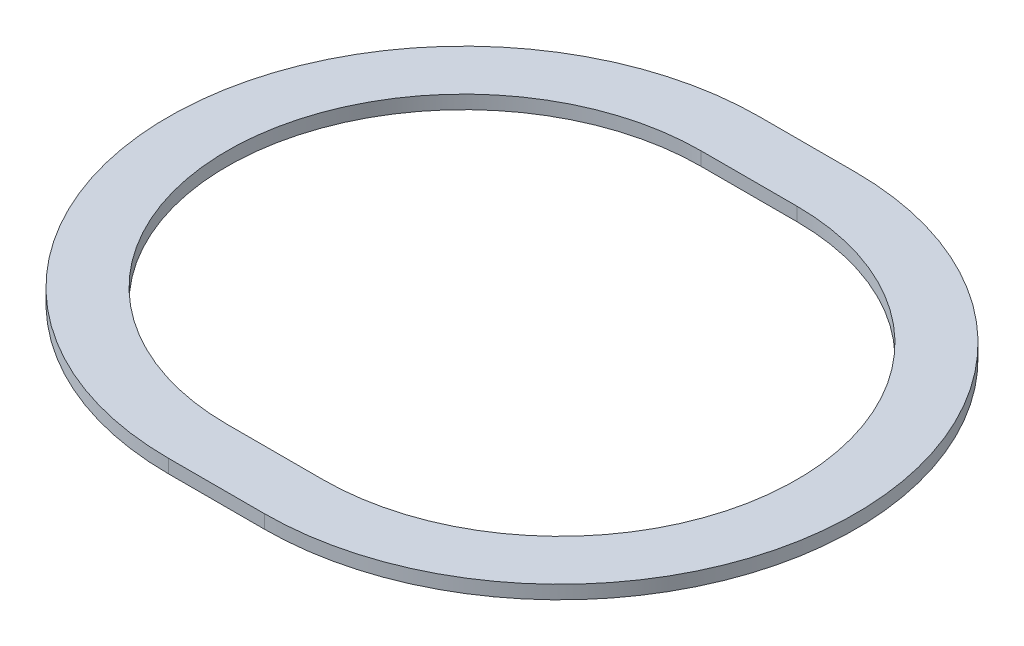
ISO-10303-21;
HEADER;
FILE_DESCRIPTION(('STEP AP214'),'2;1');
FILE_NAME('part.step','',(''),(''),'','','');
FILE_SCHEMA(('AUTOMOTIVE_DESIGN { 1 0 10303 214 1 1 1 1 }'));
ENDSEC;
DATA;
#1=APPLICATION_CONTEXT('core data for automotive mechanical design processes');
#2=APPLICATION_PROTOCOL_DEFINITION('international standard','automotive_design',2000,#1);
#3=PRODUCT_CONTEXT('',#1,'mechanical');
#4=PRODUCT('Part','Part','',(#3));
#5=PRODUCT_RELATED_PRODUCT_CATEGORY('part','',(#4));
#6=PRODUCT_DEFINITION_FORMATION('','',#4);
#7=PRODUCT_DEFINITION_CONTEXT('part definition',#1,'design');
#8=PRODUCT_DEFINITION('design','',#6,#7);
#9=PRODUCT_DEFINITION_SHAPE('','',#8);
#10=(LENGTH_UNIT() NAMED_UNIT(*) SI_UNIT(.MILLI.,.METRE.));
#11=(NAMED_UNIT(*) PLANE_ANGLE_UNIT() SI_UNIT($,.RADIAN.));
#12=(NAMED_UNIT(*) SI_UNIT($,.STERADIAN.) SOLID_ANGLE_UNIT());
#13=UNCERTAINTY_MEASURE_WITH_UNIT(LENGTH_MEASURE(1.E-05),#10,'distance_accuracy_value','');
#14=(GEOMETRIC_REPRESENTATION_CONTEXT(3) GLOBAL_UNCERTAINTY_ASSIGNED_CONTEXT((#13)) GLOBAL_UNIT_ASSIGNED_CONTEXT((#10,
#11,#12)) REPRESENTATION_CONTEXT('',''));
#15=CARTESIAN_POINT('',(0.,0.,0.));
#16=DIRECTION('',(0.,0.,1.));
#17=DIRECTION('',(1.,0.,0.));
#18=AXIS2_PLACEMENT_3D('',#15,#16,#17);
#19=CARTESIAN_POINT('',(-100.076,1.001,356.057664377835));
#20=DIRECTION('',(0.,-1.,0.));
#21=DIRECTION('',(0.,0.,-1.));
#22=AXIS2_PLACEMENT_3D('',#19,#20,#21);
#23=CYLINDRICAL_SURFACE('',#22,21.9264032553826);
#24=CARTESIAN_POINT('',(-100.076,0.000999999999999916,356.057664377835));
#25=DIRECTION('',(0.,-1.,0.));
#26=DIRECTION('',(0.,0.,-1.));
#27=AXIS2_PLACEMENT_3D('',#24,#25,#26);
#28=CIRCLE('',#27,21.9264032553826);
#29=CARTESIAN_POINT('',(-100.076,0.001,334.131261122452));
#30=VERTEX_POINT('',#29);
#31=CARTESIAN_POINT('',(-100.076,0.001,377.984067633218));
#32=VERTEX_POINT('',#31);
#33=EDGE_CURVE('E122',#30,#32,#28,.T.);
#34=ORIENTED_EDGE('',*,*,#33,.F.);
#35=DIRECTION('',(0.,-1.,0.));
#36=VECTOR('',#35,1.);
#37=CARTESIAN_POINT('',(-100.076,1.001,334.131261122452));
#38=LINE('',#37,#36);
#39=CARTESIAN_POINT('',(-100.076,1.001,334.131261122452));
#40=VERTEX_POINT('',#39);
#41=EDGE_CURVE('E33',#40,#30,#38,.T.);
#42=ORIENTED_EDGE('',*,*,#41,.F.);
#43=CARTESIAN_POINT('',(-100.076,1.001,356.057664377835));
#44=DIRECTION('',(0.,-1.,0.));
#45=DIRECTION('',(0.,0.,-1.));
#46=AXIS2_PLACEMENT_3D('',#43,#44,#45);
#47=CIRCLE('',#46,21.9264032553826);
#48=CARTESIAN_POINT('',(-100.076,1.001,377.984067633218));
#49=VERTEX_POINT('',#48);
#50=EDGE_CURVE('E101',#40,#49,#47,.T.);
#51=ORIENTED_EDGE('',*,*,#50,.T.);
#52=DIRECTION('',(0.,-1.,0.));
#53=VECTOR('',#52,1.);
#54=CARTESIAN_POINT('',(-100.076,1.001,377.984067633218));
#55=LINE('',#54,#53);
#56=EDGE_CURVE('E9',#49,#32,#55,.T.);
#57=ORIENTED_EDGE('',*,*,#56,.T.);
#58=EDGE_LOOP('',(#34,#42,#51,#57));
#59=FACE_BOUND('',#58,.T.);
#60=ADVANCED_FACE('F14',(#59),#23,.T.);
#61=CARTESIAN_POINT('',(-100.076,1.001,377.984067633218));
#62=DIRECTION('',(0.,0.,1.));
#63=DIRECTION('',(1.,0.,0.));
#64=AXIS2_PLACEMENT_3D('',#61,#62,#63);
#65=PLANE('',#64);
#66=DIRECTION('',(-1.,0.,0.));
#67=VECTOR('',#66,1.);
#68=CARTESIAN_POINT('',(-100.076,0.001,377.984067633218));
#69=LINE('',#68,#67);
#70=CARTESIAN_POINT('',(-107.188,0.001,377.984067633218));
#71=VERTEX_POINT('',#70);
#72=EDGE_CURVE('E125',#32,#71,#69,.T.);
#73=ORIENTED_EDGE('',*,*,#72,.F.);
#74=ORIENTED_EDGE('',*,*,#56,.F.);
#75=DIRECTION('',(-1.,0.,0.));
#76=VECTOR('',#75,1.);
#77=CARTESIAN_POINT('',(-100.076,1.001,377.984067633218));
#78=LINE('',#77,#76);
#79=CARTESIAN_POINT('',(-107.188,1.001,377.984067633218));
#80=VERTEX_POINT('',#79);
#81=EDGE_CURVE('E97',#49,#80,#78,.T.);
#82=ORIENTED_EDGE('',*,*,#81,.T.);
#83=DIRECTION('',(0.,-1.,0.));
#84=VECTOR('',#83,1.);
#85=CARTESIAN_POINT('',(-107.188,1.001,377.984067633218));
#86=LINE('',#85,#84);
#87=EDGE_CURVE('E24',#80,#71,#86,.T.);
#88=ORIENTED_EDGE('',*,*,#87,.T.);
#89=EDGE_LOOP('',(#73,#74,#82,#88));
#90=FACE_BOUND('',#89,.T.);
#91=ADVANCED_FACE('F98',(#90),#65,.T.);
#92=CARTESIAN_POINT('',(-107.188,1.001,356.057664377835));
#93=DIRECTION('',(0.,-1.,0.));
#94=DIRECTION('',(0.,0.,-1.));
#95=AXIS2_PLACEMENT_3D('',#92,#93,#94);
#96=CYLINDRICAL_SURFACE('',#95,21.9264032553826);
#97=CARTESIAN_POINT('',(-107.188,0.000999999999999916,356.057664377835));
#98=DIRECTION('',(0.,-1.,0.));
#99=DIRECTION('',(0.,0.,1.));
#100=AXIS2_PLACEMENT_3D('',#97,#98,#99);
#101=CIRCLE('',#100,21.9264032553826);
#102=CARTESIAN_POINT('',(-107.188,0.001,334.131261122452));
#103=VERTEX_POINT('',#102);
#104=EDGE_CURVE('E91',#71,#103,#101,.T.);
#105=ORIENTED_EDGE('',*,*,#104,.F.);
#106=ORIENTED_EDGE('',*,*,#87,.F.);
#107=CARTESIAN_POINT('',(-107.188,1.001,356.057664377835));
#108=DIRECTION('',(0.,-1.,0.));
#109=DIRECTION('',(0.,0.,1.));
#110=AXIS2_PLACEMENT_3D('',#107,#108,#109);
#111=CIRCLE('',#110,21.9264032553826);
#112=CARTESIAN_POINT('',(-107.188,1.001,334.131261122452));
#113=VERTEX_POINT('',#112);
#114=EDGE_CURVE('E88',#80,#113,#111,.T.);
#115=ORIENTED_EDGE('',*,*,#114,.T.);
#116=DIRECTION('',(0.,-1.,0.));
#117=VECTOR('',#116,1.);
#118=CARTESIAN_POINT('',(-107.188,1.001,334.131261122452));
#119=LINE('',#118,#117);
#120=EDGE_CURVE('E61',#113,#103,#119,.T.);
#121=ORIENTED_EDGE('',*,*,#120,.T.);
#122=EDGE_LOOP('',(#105,#106,#115,#121));
#123=FACE_BOUND('',#122,.T.);
#124=ADVANCED_FACE('F86',(#123),#96,.T.);
#125=CARTESIAN_POINT('',(-107.188,1.001,373.628261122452));
#126=DIRECTION('',(0.,0.,-1.));
#127=DIRECTION('',(-1.,0.,0.));
#128=AXIS2_PLACEMENT_3D('',#125,#126,#127);
#129=PLANE('',#128);
#130=DIRECTION('',(1.,0.,0.));
#131=VECTOR('',#130,1.);
#132=CARTESIAN_POINT('',(-107.188,0.001,373.628261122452));
#133=LINE('',#132,#131);
#134=CARTESIAN_POINT('',(-107.188,0.001,373.628261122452));
#135=VERTEX_POINT('',#134);
#136=CARTESIAN_POINT('',(-100.076,0.001,373.628261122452));
#137=VERTEX_POINT('',#136);
#138=EDGE_CURVE('E110',#135,#137,#133,.T.);
#139=ORIENTED_EDGE('',*,*,#138,.F.);
#140=DIRECTION('',(0.,-1.,0.));
#141=VECTOR('',#140,1.);
#142=CARTESIAN_POINT('',(-107.188,1.001,373.628261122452));
#143=LINE('',#142,#141);
#144=CARTESIAN_POINT('',(-107.188,1.001,373.628261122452));
#145=VERTEX_POINT('',#144);
#146=EDGE_CURVE('E106',#145,#135,#143,.T.);
#147=ORIENTED_EDGE('',*,*,#146,.F.);
#148=DIRECTION('',(1.,0.,0.));
#149=VECTOR('',#148,1.);
#150=CARTESIAN_POINT('',(-107.188,1.001,373.628261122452));
#151=LINE('',#150,#149);
#152=CARTESIAN_POINT('',(-100.076,1.001,373.628261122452));
#153=VERTEX_POINT('',#152);
#154=EDGE_CURVE('E130',#145,#153,#151,.T.);
#155=ORIENTED_EDGE('',*,*,#154,.T.);
#156=DIRECTION('',(0.,-1.,0.));
#157=VECTOR('',#156,1.);
#158=CARTESIAN_POINT('',(-100.076,1.001,373.628261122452));
#159=LINE('',#158,#157);
#160=EDGE_CURVE('E18',#153,#137,#159,.T.);
#161=ORIENTED_EDGE('',*,*,#160,.T.);
#162=EDGE_LOOP('',(#139,#147,#155,#161));
#163=FACE_BOUND('',#162,.T.);
#164=ADVANCED_FACE('F16',(#163),#129,.T.);
#165=CARTESIAN_POINT('',(-100.076,1.001,356.057664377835));
#166=DIRECTION('',(0.,-1.,0.));
#167=DIRECTION('',(0.,0.,-1.));
#168=AXIS2_PLACEMENT_3D('',#165,#166,#167);
#169=CYLINDRICAL_SURFACE('',#168,17.5705967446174);
#170=CARTESIAN_POINT('',(-100.076,0.000999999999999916,356.057664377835));
#171=DIRECTION('',(0.,1.,0.));
#172=DIRECTION('',(0.,0.,1.));
#173=AXIS2_PLACEMENT_3D('',#170,#171,#172);
#174=CIRCLE('',#173,17.5705967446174);
#175=CARTESIAN_POINT('',(-100.076,0.001,338.487067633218));
#176=VERTEX_POINT('',#175);
#177=EDGE_CURVE('E113',#137,#176,#174,.T.);
#178=ORIENTED_EDGE('',*,*,#177,.F.);
#179=ORIENTED_EDGE('',*,*,#160,.F.);
#180=CARTESIAN_POINT('',(-100.076,1.001,356.057664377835));
#181=DIRECTION('',(0.,1.,0.));
#182=DIRECTION('',(0.,0.,1.));
#183=AXIS2_PLACEMENT_3D('',#180,#181,#182);
#184=CIRCLE('',#183,17.5705967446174);
#185=CARTESIAN_POINT('',(-100.076,1.001,338.487067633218));
#186=VERTEX_POINT('',#185);
#187=EDGE_CURVE('E156',#153,#186,#184,.T.);
#188=ORIENTED_EDGE('',*,*,#187,.T.);
#189=DIRECTION('',(0.,-1.,0.));
#190=VECTOR('',#189,1.);
#191=CARTESIAN_POINT('',(-100.076,1.001,338.487067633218));
#192=LINE('',#191,#190);
#193=EDGE_CURVE('E135',#186,#176,#192,.T.);
#194=ORIENTED_EDGE('',*,*,#193,.T.);
#195=EDGE_LOOP('',(#178,#179,#188,#194));
#196=FACE_BOUND('',#195,.T.);
#197=ADVANCED_FACE('F141',(#196),#169,.F.);
#198=CARTESIAN_POINT('',(-100.076,1.001,338.487067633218));
#199=DIRECTION('',(0.,0.,1.));
#200=DIRECTION('',(1.,0.,0.));
#201=AXIS2_PLACEMENT_3D('',#198,#199,#200);
#202=PLANE('',#201);
#203=DIRECTION('',(-1.,0.,0.));
#204=VECTOR('',#203,1.);
#205=CARTESIAN_POINT('',(-100.076,0.001,338.487067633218));
#206=LINE('',#205,#204);
#207=CARTESIAN_POINT('',(-107.188,0.001,338.487067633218));
#208=VERTEX_POINT('',#207);
#209=EDGE_CURVE('E116',#176,#208,#206,.T.);
#210=ORIENTED_EDGE('',*,*,#209,.F.);
#211=ORIENTED_EDGE('',*,*,#193,.F.);
#212=DIRECTION('',(-1.,0.,0.));
#213=VECTOR('',#212,1.);
#214=CARTESIAN_POINT('',(-100.076,1.001,338.487067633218));
#215=LINE('',#214,#213);
#216=CARTESIAN_POINT('',(-107.188,1.001,338.487067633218));
#217=VERTEX_POINT('',#216);
#218=EDGE_CURVE('E154',#186,#217,#215,.T.);
#219=ORIENTED_EDGE('',*,*,#218,.T.);
#220=DIRECTION('',(0.,-1.,0.));
#221=VECTOR('',#220,1.);
#222=CARTESIAN_POINT('',(-107.188,1.001,338.487067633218));
#223=LINE('',#222,#221);
#224=EDGE_CURVE('E134',#217,#208,#223,.T.);
#225=ORIENTED_EDGE('',*,*,#224,.T.);
#226=EDGE_LOOP('',(#210,#211,#219,#225));
#227=FACE_BOUND('',#226,.T.);
#228=ADVANCED_FACE('F169',(#227),#202,.T.);
#229=CARTESIAN_POINT('',(-107.188,1.001,356.057664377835));
#230=DIRECTION('',(0.,-1.,0.));
#231=DIRECTION('',(0.,0.,-1.));
#232=AXIS2_PLACEMENT_3D('',#229,#230,#231);
#233=CYLINDRICAL_SURFACE('',#232,17.5705967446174);
#234=CARTESIAN_POINT('',(-107.188,0.000999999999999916,356.057664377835));
#235=DIRECTION('',(0.,1.,0.));
#236=DIRECTION('',(0.,0.,-1.));
#237=AXIS2_PLACEMENT_3D('',#234,#235,#236);
#238=CIRCLE('',#237,17.5705967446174);
#239=EDGE_CURVE('E119',#208,#135,#238,.T.);
#240=ORIENTED_EDGE('',*,*,#239,.F.);
#241=ORIENTED_EDGE('',*,*,#224,.F.);
#242=CARTESIAN_POINT('',(-107.188,1.001,356.057664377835));
#243=DIRECTION('',(0.,1.,0.));
#244=DIRECTION('',(0.,0.,-1.));
#245=AXIS2_PLACEMENT_3D('',#242,#243,#244);
#246=CIRCLE('',#245,17.5705967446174);
#247=EDGE_CURVE('E151',#217,#145,#246,.T.);
#248=ORIENTED_EDGE('',*,*,#247,.T.);
#249=ORIENTED_EDGE('',*,*,#146,.T.);
#250=EDGE_LOOP('',(#240,#241,#248,#249));
#251=FACE_BOUND('',#250,.T.);
#252=ADVANCED_FACE('F147',(#251),#233,.F.);
#253=CARTESIAN_POINT('',(-107.188,1.001,334.131261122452));
#254=DIRECTION('',(0.,0.,-1.));
#255=DIRECTION('',(-1.,0.,0.));
#256=AXIS2_PLACEMENT_3D('',#253,#254,#255);
#257=PLANE('',#256);
#258=DIRECTION('',(1.,0.,0.));
#259=VECTOR('',#258,1.);
#260=CARTESIAN_POINT('',(-107.188,0.001,334.131261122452));
#261=LINE('',#260,#259);
#262=EDGE_CURVE('E128',#103,#30,#261,.T.);
#263=ORIENTED_EDGE('',*,*,#262,.F.);
#264=ORIENTED_EDGE('',*,*,#120,.F.);
#265=DIRECTION('',(1.,0.,0.));
#266=VECTOR('',#265,1.);
#267=CARTESIAN_POINT('',(-107.188,1.001,334.131261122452));
#268=LINE('',#267,#266);
#269=EDGE_CURVE('E104',#113,#40,#268,.T.);
#270=ORIENTED_EDGE('',*,*,#269,.T.);
#271=ORIENTED_EDGE('',*,*,#41,.T.);
#272=EDGE_LOOP('',(#263,#264,#270,#271));
#273=FACE_BOUND('',#272,.T.);
#274=ADVANCED_FACE('F160',(#273),#257,.T.);
#275=CARTESIAN_POINT('',(-103.632,1.001,371.551664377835));
#276=DIRECTION('',(0.,-1.,0.));
#277=DIRECTION('',(1.,0.,0.));
#278=AXIS2_PLACEMENT_3D('',#275,#276,#277);
#279=PLANE('',#278);
#280=ORIENTED_EDGE('',*,*,#154,.F.);
#281=ORIENTED_EDGE('',*,*,#247,.F.);
#282=ORIENTED_EDGE('',*,*,#218,.F.);
#283=ORIENTED_EDGE('',*,*,#187,.F.);
#284=EDGE_LOOP('',(#280,#281,#282,#283));
#285=FACE_BOUND('',#284,.T.);
#286=ORIENTED_EDGE('',*,*,#50,.F.);
#287=ORIENTED_EDGE('',*,*,#269,.F.);
#288=ORIENTED_EDGE('',*,*,#114,.F.);
#289=ORIENTED_EDGE('',*,*,#81,.F.);
#290=EDGE_LOOP('',(#286,#287,#288,#289));
#291=FACE_BOUND('',#290,.T.);
#292=ADVANCED_FACE('F103',(#285,#291),#279,.F.);
#293=CARTESIAN_POINT('',(-103.632,0.001,371.551664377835));
#294=DIRECTION('',(0.,-1.,0.));
#295=DIRECTION('',(1.,0.,0.));
#296=AXIS2_PLACEMENT_3D('',#293,#294,#295);
#297=PLANE('',#296);
#298=ORIENTED_EDGE('',*,*,#138,.T.);
#299=ORIENTED_EDGE('',*,*,#177,.T.);
#300=ORIENTED_EDGE('',*,*,#209,.T.);
#301=ORIENTED_EDGE('',*,*,#239,.T.);
#302=EDGE_LOOP('',(#298,#299,#300,#301));
#303=FACE_BOUND('',#302,.T.);
#304=ORIENTED_EDGE('',*,*,#33,.T.);
#305=ORIENTED_EDGE('',*,*,#72,.T.);
#306=ORIENTED_EDGE('',*,*,#104,.T.);
#307=ORIENTED_EDGE('',*,*,#262,.T.);
#308=EDGE_LOOP('',(#304,#305,#306,#307));
#309=FACE_BOUND('',#308,.T.);
#310=ADVANCED_FACE('F143',(#303,#309),#297,.T.);
#311=CLOSED_SHELL('',(#60,#91,#124,#164,#197,#228,#252,#274,#292,#310));
#312=MANIFOLD_SOLID_BREP('B1',#311);
#313=ADVANCED_BREP_SHAPE_REPRESENTATION('',(#18,#312),#14);
#314=SHAPE_DEFINITION_REPRESENTATION(#9,#313);
ENDSEC;
END-ISO-10303-21;
